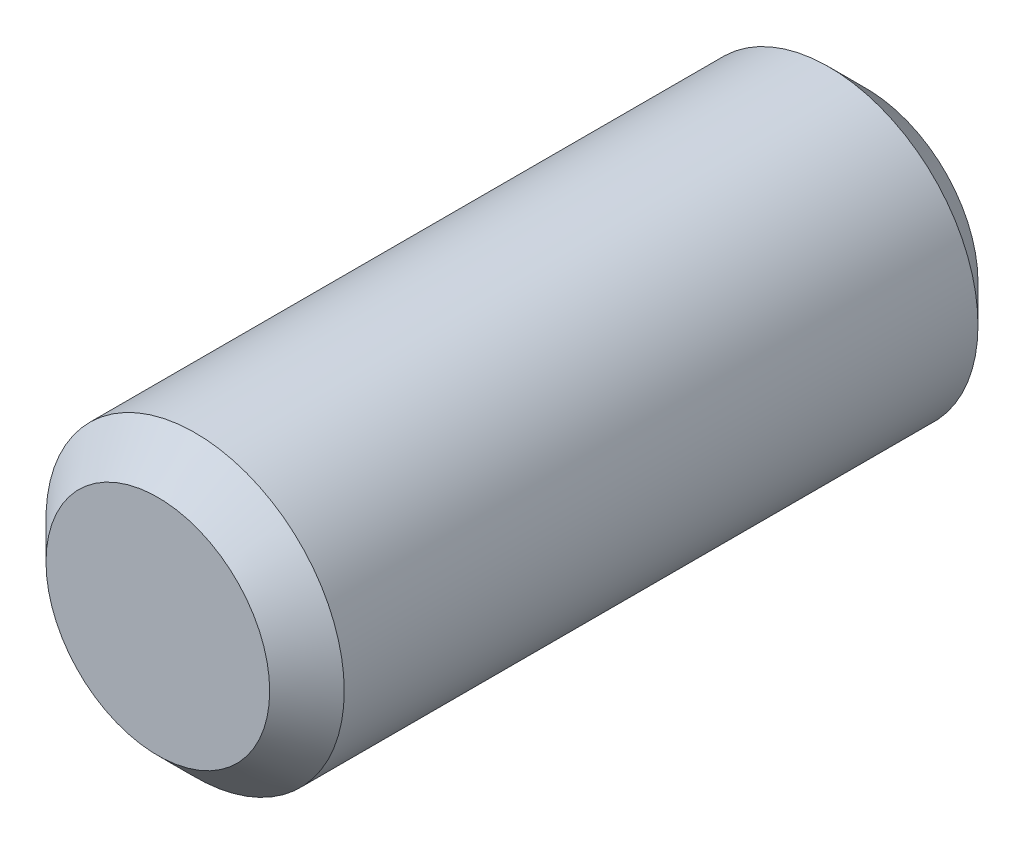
ISO-10303-21;
HEADER;
FILE_DESCRIPTION(('STEP AP214'),'2;1');
FILE_NAME('part.step','',(''),(''),'','','');
FILE_SCHEMA(('AUTOMOTIVE_DESIGN { 1 0 10303 214 1 1 1 1 }'));
ENDSEC;
DATA;
#1=APPLICATION_CONTEXT('core data for automotive mechanical design processes');
#2=APPLICATION_PROTOCOL_DEFINITION('international standard','automotive_design',2000,#1);
#3=PRODUCT_CONTEXT('',#1,'mechanical');
#4=PRODUCT('Part','Part','',(#3));
#5=PRODUCT_RELATED_PRODUCT_CATEGORY('part','',(#4));
#6=PRODUCT_DEFINITION_FORMATION('','',#4);
#7=PRODUCT_DEFINITION_CONTEXT('part definition',#1,'design');
#8=PRODUCT_DEFINITION('design','',#6,#7);
#9=PRODUCT_DEFINITION_SHAPE('','',#8);
#10=(LENGTH_UNIT() NAMED_UNIT(*) SI_UNIT(.MILLI.,.METRE.));
#11=(NAMED_UNIT(*) PLANE_ANGLE_UNIT() SI_UNIT($,.RADIAN.));
#12=(NAMED_UNIT(*) SI_UNIT($,.STERADIAN.) SOLID_ANGLE_UNIT());
#13=UNCERTAINTY_MEASURE_WITH_UNIT(LENGTH_MEASURE(1.E-05),#10,'distance_accuracy_value','');
#14=(GEOMETRIC_REPRESENTATION_CONTEXT(3) GLOBAL_UNCERTAINTY_ASSIGNED_CONTEXT((#13)) GLOBAL_UNIT_ASSIGNED_CONTEXT((#10,
#11,#12)) REPRESENTATION_CONTEXT('',''));
#15=CARTESIAN_POINT('',(0.,0.,0.));
#16=DIRECTION('',(0.,0.,1.));
#17=DIRECTION('',(1.,0.,0.));
#18=AXIS2_PLACEMENT_3D('',#15,#16,#17);
#19=CARTESIAN_POINT('',(0.,-1.11022302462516E-13,9.49999999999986));
#20=DIRECTION('',(0.,0.,-1.));
#21=DIRECTION('',(-1.,0.,0.));
#22=AXIS2_PLACEMENT_3D('',#19,#20,#21);
#23=CYLINDRICAL_SURFACE('',#22,2.);
#24=CARTESIAN_POINT('',(0.,0.,0.499999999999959));
#25=DIRECTION('',(0.,0.,1.));
#26=DIRECTION('',(1.,0.,0.));
#27=AXIS2_PLACEMENT_3D('',#24,#25,#26);
#28=CIRCLE('',#27,2.);
#29=CARTESIAN_POINT('',(2.,0.,0.499999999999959));
#30=VERTEX_POINT('',#29);
#31=EDGE_CURVE('E38',#30,#30,#28,.T.);
#32=ORIENTED_EDGE('',*,*,#31,.T.);
#33=EDGE_LOOP('',(#32));
#34=FACE_BOUND('',#33,.T.);
#35=CARTESIAN_POINT('',(0.,-1.11022302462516E-13,8.99999999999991));
#36=DIRECTION('',(0.,0.,1.));
#37=DIRECTION('',(1.,0.,0.));
#38=AXIS2_PLACEMENT_3D('',#35,#36,#37);
#39=CIRCLE('',#38,2.);
#40=CARTESIAN_POINT('',(2.,-1.11022302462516E-13,8.99999999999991));
#41=VERTEX_POINT('',#40);
#42=EDGE_CURVE('E42',#41,#41,#39,.F.);
#43=ORIENTED_EDGE('',*,*,#42,.T.);
#44=EDGE_LOOP('',(#43));
#45=FACE_BOUND('',#44,.T.);
#46=ADVANCED_FACE('F28',(#34,#45),#23,.T.);
#47=CARTESIAN_POINT('',(0.,-1.11022302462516E-13,9.49999999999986));
#48=DIRECTION('',(0.,0.,1.));
#49=DIRECTION('',(1.,0.,0.));
#50=AXIS2_PLACEMENT_3D('',#47,#48,#49);
#51=PLANE('',#50);
#52=CARTESIAN_POINT('',(0.,-1.11022302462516E-13,9.49999999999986));
#53=DIRECTION('',(0.,0.,1.));
#54=DIRECTION('',(1.,0.,0.));
#55=AXIS2_PLACEMENT_3D('',#52,#53,#54);
#56=CIRCLE('',#55,1.49999999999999);
#57=CARTESIAN_POINT('',(1.49999999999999,-1.11022302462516E-13,9.49999999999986));
#58=VERTEX_POINT('',#57);
#59=EDGE_CURVE('E10',#58,#58,#56,.T.);
#60=ORIENTED_EDGE('',*,*,#59,.T.);
#61=EDGE_LOOP('',(#60));
#62=FACE_BOUND('',#61,.T.);
#63=ADVANCED_FACE('F60',(#62),#51,.T.);
#64=CARTESIAN_POINT('',(0.,0.,0.));
#65=DIRECTION('',(0.,0.,1.));
#66=DIRECTION('',(1.,0.,0.));
#67=AXIS2_PLACEMENT_3D('',#64,#65,#66);
#68=PLANE('',#67);
#69=CARTESIAN_POINT('',(0.,0.,0.));
#70=DIRECTION('',(0.,0.,1.));
#71=DIRECTION('',(1.,0.,0.));
#72=AXIS2_PLACEMENT_3D('',#69,#70,#71);
#73=CIRCLE('',#72,1.5);
#74=CARTESIAN_POINT('',(1.5,0.,0.));
#75=VERTEX_POINT('',#74);
#76=EDGE_CURVE('E34',#75,#75,#73,.F.);
#77=ORIENTED_EDGE('',*,*,#76,.T.);
#78=EDGE_LOOP('',(#77));
#79=FACE_BOUND('',#78,.T.);
#80=ADVANCED_FACE('F57',(#79),#68,.F.);
#81=CARTESIAN_POINT('',(0.,0.,0.499999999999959));
#82=DIRECTION('',(0.,0.,1.));
#83=DIRECTION('',(1.,0.,0.));
#84=AXIS2_PLACEMENT_3D('',#81,#82,#83);
#85=CONICAL_SURFACE('',#84,2.,0.785398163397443);
#86=ORIENTED_EDGE('',*,*,#76,.F.);
#87=EDGE_LOOP('',(#86));
#88=FACE_BOUND('',#87,.T.);
#89=ORIENTED_EDGE('',*,*,#31,.F.);
#90=EDGE_LOOP('',(#89));
#91=FACE_BOUND('',#90,.T.);
#92=ADVANCED_FACE('F52',(#88,#91),#85,.T.);
#93=CARTESIAN_POINT('',(0.,-1.11022302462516E-13,9.49999999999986));
#94=DIRECTION('',(0.,0.,-1.));
#95=DIRECTION('',(-1.,0.,0.));
#96=AXIS2_PLACEMENT_3D('',#93,#94,#95);
#97=CONICAL_SURFACE('',#96,1.49999999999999,0.785398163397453);
#98=ORIENTED_EDGE('',*,*,#42,.F.);
#99=EDGE_LOOP('',(#98));
#100=FACE_BOUND('',#99,.T.);
#101=ORIENTED_EDGE('',*,*,#59,.F.);
#102=EDGE_LOOP('',(#101));
#103=FACE_BOUND('',#102,.T.);
#104=ADVANCED_FACE('F49',(#100,#103),#97,.T.);
#105=CLOSED_SHELL('',(#46,#63,#80,#92,#104));
#106=MANIFOLD_SOLID_BREP('B2',#105);
#107=ADVANCED_BREP_SHAPE_REPRESENTATION('',(#18,#106),#14);
#108=SHAPE_DEFINITION_REPRESENTATION(#9,#107);
ENDSEC;
END-ISO-10303-21;
